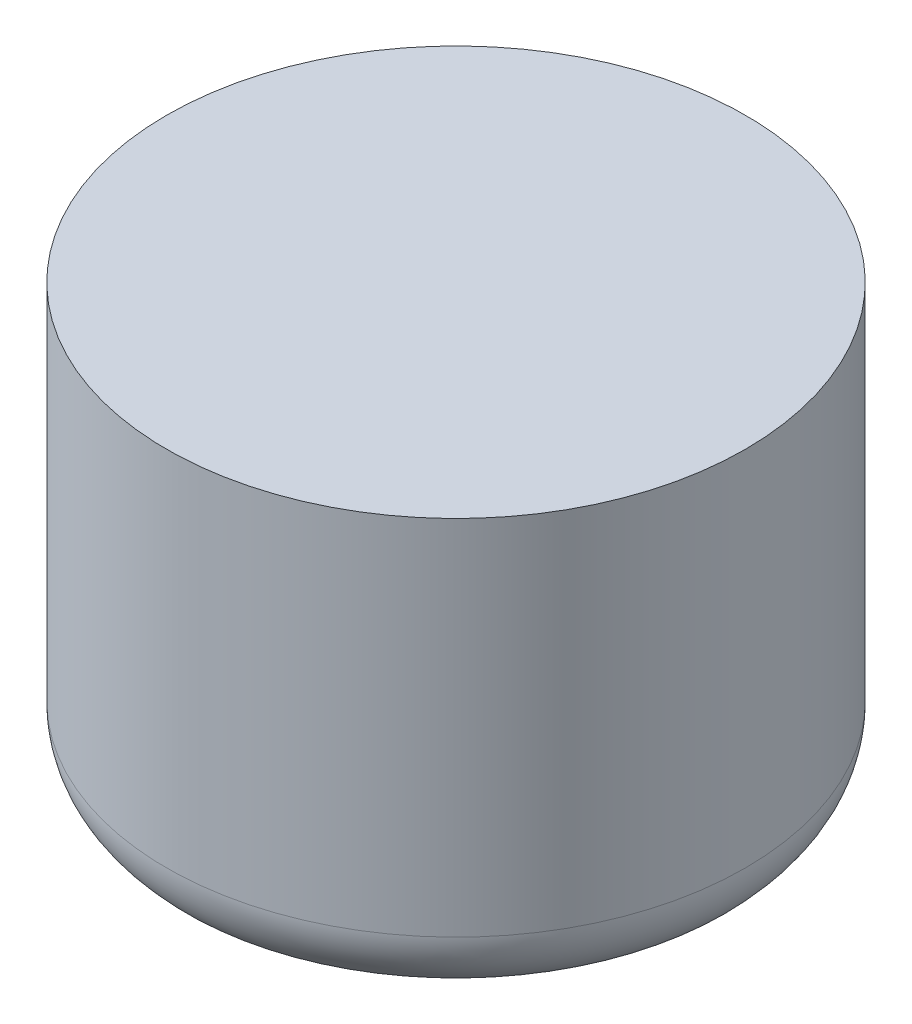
ISO-10303-21;
HEADER;
FILE_DESCRIPTION(('STEP AP214'),'2;1');
FILE_NAME('part.step','',(''),(''),'','','');
FILE_SCHEMA(('AUTOMOTIVE_DESIGN { 1 0 10303 214 1 1 1 1 }'));
ENDSEC;
DATA;
#1=APPLICATION_CONTEXT('core data for automotive mechanical design processes');
#2=APPLICATION_PROTOCOL_DEFINITION('international standard','automotive_design',2000,#1);
#3=PRODUCT_CONTEXT('',#1,'mechanical');
#4=PRODUCT('Part','Part','',(#3));
#5=PRODUCT_RELATED_PRODUCT_CATEGORY('part','',(#4));
#6=PRODUCT_DEFINITION_FORMATION('','',#4);
#7=PRODUCT_DEFINITION_CONTEXT('part definition',#1,'design');
#8=PRODUCT_DEFINITION('design','',#6,#7);
#9=PRODUCT_DEFINITION_SHAPE('','',#8);
#10=(LENGTH_UNIT() NAMED_UNIT(*) SI_UNIT(.MILLI.,.METRE.));
#11=(NAMED_UNIT(*) PLANE_ANGLE_UNIT() SI_UNIT($,.RADIAN.));
#12=(NAMED_UNIT(*) SI_UNIT($,.STERADIAN.) SOLID_ANGLE_UNIT());
#13=UNCERTAINTY_MEASURE_WITH_UNIT(LENGTH_MEASURE(1.E-05),#10,'distance_accuracy_value','');
#14=(GEOMETRIC_REPRESENTATION_CONTEXT(3) GLOBAL_UNCERTAINTY_ASSIGNED_CONTEXT((#13)) GLOBAL_UNIT_ASSIGNED_CONTEXT((#10,
#11,#12)) REPRESENTATION_CONTEXT('',''));
#15=CARTESIAN_POINT('',(0.,0.,0.));
#16=DIRECTION('',(0.,0.,1.));
#17=DIRECTION('',(1.,0.,0.));
#18=AXIS2_PLACEMENT_3D('',#15,#16,#17);
#19=CARTESIAN_POINT('',(-70.9186877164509,54.6389066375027,0.));
#20=DIRECTION('',(0.,1.,0.));
#21=DIRECTION('',(-1.,0.,0.));
#22=AXIS2_PLACEMENT_3D('',#19,#20,#21);
#23=TOROIDAL_SURFACE('',#22,37.09,12.);
#24=CARTESIAN_POINT('',(-70.9186877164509,46.1489066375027,0.));
#25=DIRECTION('',(0.,1.,0.));
#26=DIRECTION('',(-1.,0.,0.));
#27=AXIS2_PLACEMENT_3D('',#24,#25,#26);
#28=CIRCLE('',#27,45.5705601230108);
#29=CARTESIAN_POINT('',(-116.489247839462,46.1489066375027,0.));
#30=VERTEX_POINT('',#29);
#31=EDGE_CURVE('E10',#30,#30,#28,.T.);
#32=ORIENTED_EDGE('',*,*,#31,.T.);
#33=EDGE_LOOP('',(#32));
#34=FACE_BOUND('',#33,.T.);
#35=CARTESIAN_POINT('',(-70.9186877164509,54.6389066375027,0.));
#36=DIRECTION('',(0.,1.,0.));
#37=DIRECTION('',(-1.,0.,0.));
#38=AXIS2_PLACEMENT_3D('',#35,#36,#37);
#39=CIRCLE('',#38,49.09);
#40=CARTESIAN_POINT('',(-120.008687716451,54.6389066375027,0.));
#41=VERTEX_POINT('',#40);
#42=EDGE_CURVE('E41',#41,#41,#39,.T.);
#43=ORIENTED_EDGE('',*,*,#42,.F.);
#44=EDGE_LOOP('',(#43));
#45=FACE_BOUND('',#44,.T.);
#46=ADVANCED_FACE('F31',(#34,#45),#23,.T.);
#47=CARTESIAN_POINT('',(-116.489247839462,46.1489066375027,0.));
#48=DIRECTION('',(0.,-1.,0.));
#49=DIRECTION('',(1.,0.,0.));
#50=AXIS2_PLACEMENT_3D('',#47,#48,#49);
#51=PLANE('',#50);
#52=ORIENTED_EDGE('',*,*,#31,.F.);
#53=EDGE_LOOP('',(#52));
#54=FACE_BOUND('',#53,.T.);
#55=ADVANCED_FACE('F52',(#54),#51,.T.);
#56=CARTESIAN_POINT('',(-120.008687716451,116.148906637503,0.));
#57=DIRECTION('',(0.,1.,0.));
#58=DIRECTION('',(-1.,0.,0.));
#59=AXIS2_PLACEMENT_3D('',#56,#57,#58);
#60=PLANE('',#59);
#61=CARTESIAN_POINT('',(-70.9186877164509,116.148906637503,0.));
#62=DIRECTION('',(0.,1.,0.));
#63=DIRECTION('',(-1.,0.,0.));
#64=AXIS2_PLACEMENT_3D('',#61,#62,#63);
#65=CIRCLE('',#64,49.09);
#66=CARTESIAN_POINT('',(-120.008687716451,116.148906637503,0.));
#67=VERTEX_POINT('',#66);
#68=EDGE_CURVE('E37',#67,#67,#65,.T.);
#69=ORIENTED_EDGE('',*,*,#68,.T.);
#70=EDGE_LOOP('',(#69));
#71=FACE_BOUND('',#70,.T.);
#72=ADVANCED_FACE('F56',(#71),#60,.T.);
#73=CARTESIAN_POINT('',(-70.9186877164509,164.899410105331,0.));
#74=DIRECTION('',(0.,1.,0.));
#75=DIRECTION('',(-1.,0.,0.));
#76=AXIS2_PLACEMENT_3D('',#73,#74,#75);
#77=CYLINDRICAL_SURFACE('',#76,49.09);
#78=ORIENTED_EDGE('',*,*,#42,.T.);
#79=EDGE_LOOP('',(#78));
#80=FACE_BOUND('',#79,.T.);
#81=ORIENTED_EDGE('',*,*,#68,.F.);
#82=EDGE_LOOP('',(#81));
#83=FACE_BOUND('',#82,.T.);
#84=ADVANCED_FACE('F48',(#80,#83),#77,.T.);
#85=CLOSED_SHELL('',(#46,#55,#72,#84));
#86=MANIFOLD_SOLID_BREP('B2',#85);
#87=ADVANCED_BREP_SHAPE_REPRESENTATION('',(#18,#86),#14);
#88=SHAPE_DEFINITION_REPRESENTATION(#9,#87);
ENDSEC;
END-ISO-10303-21;
